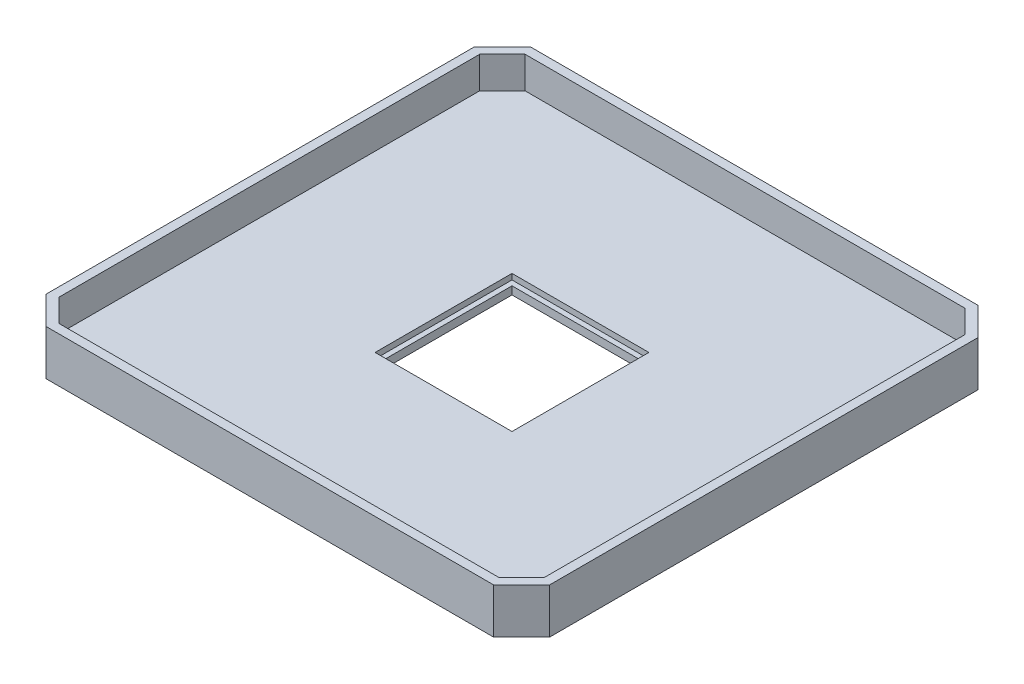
ISO-10303-21;
HEADER;
FILE_DESCRIPTION(('STEP AP214'),'2;1');
FILE_NAME('part.step','',(''),(''),'','','');
FILE_SCHEMA(('AUTOMOTIVE_DESIGN { 1 0 10303 214 1 1 1 1 }'));
ENDSEC;
DATA;
#1=APPLICATION_CONTEXT('core data for automotive mechanical design processes');
#2=APPLICATION_PROTOCOL_DEFINITION('international standard','automotive_design',2000,#1);
#3=PRODUCT_CONTEXT('',#1,'mechanical');
#4=PRODUCT('Part','Part','',(#3));
#5=PRODUCT_RELATED_PRODUCT_CATEGORY('part','',(#4));
#6=PRODUCT_DEFINITION_FORMATION('','',#4);
#7=PRODUCT_DEFINITION_CONTEXT('part definition',#1,'design');
#8=PRODUCT_DEFINITION('design','',#6,#7);
#9=PRODUCT_DEFINITION_SHAPE('','',#8);
#10=(LENGTH_UNIT() NAMED_UNIT(*) SI_UNIT(.MILLI.,.METRE.));
#11=(NAMED_UNIT(*) PLANE_ANGLE_UNIT() SI_UNIT($,.RADIAN.));
#12=(NAMED_UNIT(*) SI_UNIT($,.STERADIAN.) SOLID_ANGLE_UNIT());
#13=UNCERTAINTY_MEASURE_WITH_UNIT(LENGTH_MEASURE(1.E-05),#10,'distance_accuracy_value','');
#14=(GEOMETRIC_REPRESENTATION_CONTEXT(3) GLOBAL_UNCERTAINTY_ASSIGNED_CONTEXT((#13)) GLOBAL_UNIT_ASSIGNED_CONTEXT((#10,
#11,#12)) REPRESENTATION_CONTEXT('',''));
#15=CARTESIAN_POINT('',(0.,0.,0.));
#16=DIRECTION('',(0.,0.,1.));
#17=DIRECTION('',(1.,0.,0.));
#18=AXIS2_PLACEMENT_3D('',#15,#16,#17);
#19=CARTESIAN_POINT('',(0.,10.,0.));
#20=DIRECTION('',(0.,1.,0.));
#21=DIRECTION('',(0.,0.,1.));
#22=AXIS2_PLACEMENT_3D('',#19,#20,#21);
#23=PLANE('',#22);
#24=DIRECTION('',(0.707106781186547,0.,0.707106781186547));
#25=VECTOR('',#24,1.);
#26=CARTESIAN_POINT('',(-55.625,10.,47.3284271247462));
#27=LINE('',#26,#25);
#28=CARTESIAN_POINT('',(-55.625,10.,47.3284271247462));
#29=VERTEX_POINT('',#28);
#30=CARTESIAN_POINT('',(-49.4534271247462,10.,53.5));
#31=VERTEX_POINT('',#30);
#32=EDGE_CURVE('E372',#29,#31,#27,.T.);
#33=ORIENTED_EDGE('',*,*,#32,.T.);
#34=DIRECTION('',(1.,0.,0.));
#35=VECTOR('',#34,1.);
#36=CARTESIAN_POINT('',(-49.4534271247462,10.,53.5));
#37=LINE('',#36,#35);
#38=CARTESIAN_POINT('',(49.4534271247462,10.,53.5));
#39=VERTEX_POINT('',#38);
#40=EDGE_CURVE('E376',#31,#39,#37,.T.);
#41=ORIENTED_EDGE('',*,*,#40,.T.);
#42=DIRECTION('',(0.707106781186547,0.,-0.707106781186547));
#43=VECTOR('',#42,1.);
#44=CARTESIAN_POINT('',(49.4534271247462,10.,53.5));
#45=LINE('',#44,#43);
#46=CARTESIAN_POINT('',(55.625,10.,47.3284271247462));
#47=VERTEX_POINT('',#46);
#48=EDGE_CURVE('E380',#39,#47,#45,.T.);
#49=ORIENTED_EDGE('',*,*,#48,.T.);
#50=DIRECTION('',(0.,0.,-1.));
#51=VECTOR('',#50,1.);
#52=CARTESIAN_POINT('',(55.625,10.,47.3284271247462));
#53=LINE('',#52,#51);
#54=CARTESIAN_POINT('',(55.625,10.,-47.3284271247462));
#55=VERTEX_POINT('',#54);
#56=EDGE_CURVE('E383',#47,#55,#53,.T.);
#57=ORIENTED_EDGE('',*,*,#56,.T.);
#58=DIRECTION('',(-0.707106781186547,0.,-0.707106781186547));
#59=VECTOR('',#58,1.);
#60=CARTESIAN_POINT('',(49.4534271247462,10.,-53.5));
#61=LINE('',#60,#59);
#62=CARTESIAN_POINT('',(49.4534271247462,10.,-53.5));
#63=VERTEX_POINT('',#62);
#64=EDGE_CURVE('E386',#55,#63,#61,.T.);
#65=ORIENTED_EDGE('',*,*,#64,.T.);
#66=DIRECTION('',(-1.,0.,0.));
#67=VECTOR('',#66,1.);
#68=CARTESIAN_POINT('',(-49.4534271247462,10.,-53.5));
#69=LINE('',#68,#67);
#70=CARTESIAN_POINT('',(-49.4534271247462,10.,-53.5));
#71=VERTEX_POINT('',#70);
#72=EDGE_CURVE('E389',#63,#71,#69,.T.);
#73=ORIENTED_EDGE('',*,*,#72,.T.);
#74=DIRECTION('',(-0.707106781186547,0.,0.707106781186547));
#75=VECTOR('',#74,1.);
#76=CARTESIAN_POINT('',(-55.625,10.,-47.3284271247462));
#77=LINE('',#76,#75);
#78=CARTESIAN_POINT('',(-55.625,10.,-47.3284271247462));
#79=VERTEX_POINT('',#78);
#80=EDGE_CURVE('E392',#71,#79,#77,.T.);
#81=ORIENTED_EDGE('',*,*,#80,.T.);
#82=DIRECTION('',(0.,0.,1.));
#83=VECTOR('',#82,1.);
#84=CARTESIAN_POINT('',(-55.625,10.,47.3284271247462));
#85=LINE('',#84,#83);
#86=EDGE_CURVE('E395',#79,#29,#85,.T.);
#87=ORIENTED_EDGE('',*,*,#86,.T.);
#88=EDGE_LOOP('',(#33,#41,#49,#57,#65,#73,#81,#87));
#89=FACE_BOUND('',#88,.T.);
#90=DIRECTION('',(-0.707106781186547,0.,0.707106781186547));
#91=VECTOR('',#90,1.);
#92=CARTESIAN_POINT('',(-53.625,10.,-46.5));
#93=LINE('',#92,#91);
#94=CARTESIAN_POINT('',(-48.625,10.,-51.5));
#95=VERTEX_POINT('',#94);
#96=CARTESIAN_POINT('',(-53.625,10.,-46.5));
#97=VERTEX_POINT('',#96);
#98=EDGE_CURVE('E318',#95,#97,#93,.T.);
#99=ORIENTED_EDGE('',*,*,#98,.F.);
#100=DIRECTION('',(-1.,0.,0.));
#101=VECTOR('',#100,1.);
#102=CARTESIAN_POINT('',(-48.625,10.,-51.5));
#103=LINE('',#102,#101);
#104=CARTESIAN_POINT('',(48.625,10.,-51.5));
#105=VERTEX_POINT('',#104);
#106=EDGE_CURVE('E315',#105,#95,#103,.T.);
#107=ORIENTED_EDGE('',*,*,#106,.F.);
#108=DIRECTION('',(-0.707106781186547,0.,-0.707106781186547));
#109=VECTOR('',#108,1.);
#110=CARTESIAN_POINT('',(48.625,10.,-51.5));
#111=LINE('',#110,#109);
#112=CARTESIAN_POINT('',(53.625,10.,-46.5));
#113=VERTEX_POINT('',#112);
#114=EDGE_CURVE('E337',#113,#105,#111,.T.);
#115=ORIENTED_EDGE('',*,*,#114,.F.);
#116=DIRECTION('',(0.,0.,-1.));
#117=VECTOR('',#116,1.);
#118=CARTESIAN_POINT('',(53.625,10.,46.5));
#119=LINE('',#118,#117);
#120=CARTESIAN_POINT('',(53.625,10.,46.5));
#121=VERTEX_POINT('',#120);
#122=EDGE_CURVE('E333',#121,#113,#119,.T.);
#123=ORIENTED_EDGE('',*,*,#122,.F.);
#124=DIRECTION('',(0.707106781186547,0.,-0.707106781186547));
#125=VECTOR('',#124,1.);
#126=CARTESIAN_POINT('',(48.625,10.,51.5));
#127=LINE('',#126,#125);
#128=CARTESIAN_POINT('',(48.625,10.,51.5));
#129=VERTEX_POINT('',#128);
#130=EDGE_CURVE('E330',#129,#121,#127,.T.);
#131=ORIENTED_EDGE('',*,*,#130,.F.);
#132=DIRECTION('',(1.,0.,0.));
#133=VECTOR('',#132,1.);
#134=CARTESIAN_POINT('',(-48.625,10.,51.5));
#135=LINE('',#134,#133);
#136=CARTESIAN_POINT('',(-48.625,10.,51.5));
#137=VERTEX_POINT('',#136);
#138=EDGE_CURVE('E327',#137,#129,#135,.T.);
#139=ORIENTED_EDGE('',*,*,#138,.F.);
#140=DIRECTION('',(0.707106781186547,0.,0.707106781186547));
#141=VECTOR('',#140,1.);
#142=CARTESIAN_POINT('',(-53.625,10.,46.5));
#143=LINE('',#142,#141);
#144=CARTESIAN_POINT('',(-53.625,10.,46.5));
#145=VERTEX_POINT('',#144);
#146=EDGE_CURVE('E324',#145,#137,#143,.T.);
#147=ORIENTED_EDGE('',*,*,#146,.F.);
#148=DIRECTION('',(0.,0.,1.));
#149=VECTOR('',#148,1.);
#150=CARTESIAN_POINT('',(-53.625,10.,46.5));
#151=LINE('',#150,#149);
#152=EDGE_CURVE('E321',#97,#145,#151,.T.);
#153=ORIENTED_EDGE('',*,*,#152,.F.);
#154=EDGE_LOOP('',(#99,#107,#115,#123,#131,#139,#147,#153));
#155=FACE_BOUND('',#154,.T.);
#156=ADVANCED_FACE('F41',(#89,#155),#23,.T.);
#157=CARTESIAN_POINT('',(0.,0.,0.));
#158=DIRECTION('',(0.,1.,0.));
#159=DIRECTION('',(0.,0.,1.));
#160=AXIS2_PLACEMENT_3D('',#157,#158,#159);
#161=PLANE('',#160);
#162=DIRECTION('',(0.707106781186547,0.,0.707106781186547));
#163=VECTOR('',#162,1.);
#164=CARTESIAN_POINT('',(-55.625,0.,47.3284271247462));
#165=LINE('',#164,#163);
#166=CARTESIAN_POINT('',(-55.625,0.,47.3284271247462));
#167=VERTEX_POINT('',#166);
#168=CARTESIAN_POINT('',(-49.4534271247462,0.,53.5));
#169=VERTEX_POINT('',#168);
#170=EDGE_CURVE('E371',#167,#169,#165,.T.);
#171=ORIENTED_EDGE('',*,*,#170,.F.);
#172=DIRECTION('',(0.,0.,1.));
#173=VECTOR('',#172,1.);
#174=CARTESIAN_POINT('',(-55.625,0.,47.3284271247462));
#175=LINE('',#174,#173);
#176=CARTESIAN_POINT('',(-55.625,0.,-47.3284271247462));
#177=VERTEX_POINT('',#176);
#178=EDGE_CURVE('E377',#177,#167,#175,.T.);
#179=ORIENTED_EDGE('',*,*,#178,.F.);
#180=DIRECTION('',(-0.707106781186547,0.,0.707106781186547));
#181=VECTOR('',#180,1.);
#182=CARTESIAN_POINT('',(-55.625,0.,-47.3284271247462));
#183=LINE('',#182,#181);
#184=CARTESIAN_POINT('',(-49.4534271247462,0.,-53.5));
#185=VERTEX_POINT('',#184);
#186=EDGE_CURVE('E417',#185,#177,#183,.T.);
#187=ORIENTED_EDGE('',*,*,#186,.F.);
#188=DIRECTION('',(-1.,0.,0.));
#189=VECTOR('',#188,1.);
#190=CARTESIAN_POINT('',(-49.4534271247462,0.,-53.5));
#191=LINE('',#190,#189);
#192=CARTESIAN_POINT('',(49.4534271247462,0.,-53.5));
#193=VERTEX_POINT('',#192);
#194=EDGE_CURVE('E414',#193,#185,#191,.T.);
#195=ORIENTED_EDGE('',*,*,#194,.F.);
#196=DIRECTION('',(-0.707106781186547,0.,-0.707106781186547));
#197=VECTOR('',#196,1.);
#198=CARTESIAN_POINT('',(49.4534271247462,0.,-53.5));
#199=LINE('',#198,#197);
#200=CARTESIAN_POINT('',(55.625,0.,-47.3284271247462));
#201=VERTEX_POINT('',#200);
#202=EDGE_CURVE('E411',#201,#193,#199,.T.);
#203=ORIENTED_EDGE('',*,*,#202,.F.);
#204=DIRECTION('',(0.,0.,-1.));
#205=VECTOR('',#204,1.);
#206=CARTESIAN_POINT('',(55.625,0.,47.3284271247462));
#207=LINE('',#206,#205);
#208=CARTESIAN_POINT('',(55.625,0.,47.3284271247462));
#209=VERTEX_POINT('',#208);
#210=EDGE_CURVE('E408',#209,#201,#207,.T.);
#211=ORIENTED_EDGE('',*,*,#210,.F.);
#212=DIRECTION('',(0.707106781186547,0.,-0.707106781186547));
#213=VECTOR('',#212,1.);
#214=CARTESIAN_POINT('',(49.4534271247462,0.,53.5));
#215=LINE('',#214,#213);
#216=CARTESIAN_POINT('',(49.4534271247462,0.,53.5));
#217=VERTEX_POINT('',#216);
#218=EDGE_CURVE('E405',#217,#209,#215,.T.);
#219=ORIENTED_EDGE('',*,*,#218,.F.);
#220=DIRECTION('',(1.,0.,0.));
#221=VECTOR('',#220,1.);
#222=CARTESIAN_POINT('',(-49.4534271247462,0.,53.5));
#223=LINE('',#222,#221);
#224=EDGE_CURVE('E402',#169,#217,#223,.T.);
#225=ORIENTED_EDGE('',*,*,#224,.F.);
#226=EDGE_LOOP('',(#171,#179,#187,#195,#203,#211,#219,#225));
#227=FACE_BOUND('',#226,.T.);
#228=DIRECTION('',(-1.,0.,0.));
#229=VECTOR('',#228,1.);
#230=CARTESIAN_POINT('',(-14.,0.,14.));
#231=LINE('',#230,#229);
#232=CARTESIAN_POINT('',(14.,0.,14.));
#233=VERTEX_POINT('',#232);
#234=CARTESIAN_POINT('',(-14.,0.,14.));
#235=VERTEX_POINT('',#234);
#236=EDGE_CURVE('E266',#233,#235,#231,.T.);
#237=ORIENTED_EDGE('',*,*,#236,.F.);
#238=DIRECTION('',(0.,0.,1.));
#239=VECTOR('',#238,1.);
#240=CARTESIAN_POINT('',(14.,0.,-14.));
#241=LINE('',#240,#239);
#242=CARTESIAN_POINT('',(14.,0.,-14.));
#243=VERTEX_POINT('',#242);
#244=EDGE_CURVE('E262',#243,#233,#241,.T.);
#245=ORIENTED_EDGE('',*,*,#244,.F.);
#246=DIRECTION('',(1.,0.,0.));
#247=VECTOR('',#246,1.);
#248=CARTESIAN_POINT('',(-14.,0.,-14.));
#249=LINE('',#248,#247);
#250=CARTESIAN_POINT('',(-14.,0.,-14.));
#251=VERTEX_POINT('',#250);
#252=EDGE_CURVE('E274',#251,#243,#249,.T.);
#253=ORIENTED_EDGE('',*,*,#252,.F.);
#254=DIRECTION('',(0.,0.,-1.));
#255=VECTOR('',#254,1.);
#256=CARTESIAN_POINT('',(-14.,0.,-14.));
#257=LINE('',#256,#255);
#258=EDGE_CURVE('E270',#235,#251,#257,.T.);
#259=ORIENTED_EDGE('',*,*,#258,.F.);
#260=EDGE_LOOP('',(#237,#245,#253,#259));
#261=FACE_BOUND('',#260,.T.);
#262=ADVANCED_FACE('F460',(#227,#261),#161,.F.);
#263=CARTESIAN_POINT('',(-55.625,10.,47.3284271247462));
#264=DIRECTION('',(0.707106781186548,0.,-0.707106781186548));
#265=DIRECTION('',(-0.707106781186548,0.,-0.707106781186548));
#266=AXIS2_PLACEMENT_3D('',#263,#264,#265);
#267=PLANE('',#266);
#268=ORIENTED_EDGE('',*,*,#170,.T.);
#269=DIRECTION('',(0.,-1.,0.));
#270=VECTOR('',#269,1.);
#271=CARTESIAN_POINT('',(-49.4534271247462,10.,53.5));
#272=LINE('',#271,#270);
#273=EDGE_CURVE('E50',#31,#169,#272,.T.);
#274=ORIENTED_EDGE('',*,*,#273,.F.);
#275=ORIENTED_EDGE('',*,*,#32,.F.);
#276=DIRECTION('',(0.,-1.,0.));
#277=VECTOR('',#276,1.);
#278=CARTESIAN_POINT('',(-55.625,10.,47.3284271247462));
#279=LINE('',#278,#277);
#280=EDGE_CURVE('E398',#29,#167,#279,.T.);
#281=ORIENTED_EDGE('',*,*,#280,.T.);
#282=EDGE_LOOP('',(#268,#274,#275,#281));
#283=FACE_BOUND('',#282,.T.);
#284=ADVANCED_FACE('F43',(#283),#267,.F.);
#285=CARTESIAN_POINT('',(-49.4534271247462,10.,53.5));
#286=DIRECTION('',(0.,0.,-1.));
#287=DIRECTION('',(-1.,0.,0.));
#288=AXIS2_PLACEMENT_3D('',#285,#286,#287);
#289=PLANE('',#288);
#290=ORIENTED_EDGE('',*,*,#224,.T.);
#291=DIRECTION('',(0.,-1.,0.));
#292=VECTOR('',#291,1.);
#293=CARTESIAN_POINT('',(49.4534271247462,10.,53.5));
#294=LINE('',#293,#292);
#295=EDGE_CURVE('E445',#39,#217,#294,.T.);
#296=ORIENTED_EDGE('',*,*,#295,.F.);
#297=ORIENTED_EDGE('',*,*,#40,.F.);
#298=ORIENTED_EDGE('',*,*,#273,.T.);
#299=EDGE_LOOP('',(#290,#296,#297,#298));
#300=FACE_BOUND('',#299,.T.);
#301=ADVANCED_FACE('F452',(#300),#289,.F.);
#302=CARTESIAN_POINT('',(49.4534271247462,10.,53.5));
#303=DIRECTION('',(-0.707106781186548,0.,-0.707106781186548));
#304=DIRECTION('',(-0.707106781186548,0.,0.707106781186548));
#305=AXIS2_PLACEMENT_3D('',#302,#303,#304);
#306=PLANE('',#305);
#307=ORIENTED_EDGE('',*,*,#218,.T.);
#308=DIRECTION('',(0.,-1.,0.));
#309=VECTOR('',#308,1.);
#310=CARTESIAN_POINT('',(55.625,10.,47.3284271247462));
#311=LINE('',#310,#309);
#312=EDGE_CURVE('E441',#47,#209,#311,.T.);
#313=ORIENTED_EDGE('',*,*,#312,.F.);
#314=ORIENTED_EDGE('',*,*,#48,.F.);
#315=ORIENTED_EDGE('',*,*,#295,.T.);
#316=EDGE_LOOP('',(#307,#313,#314,#315));
#317=FACE_BOUND('',#316,.T.);
#318=ADVANCED_FACE('F468',(#317),#306,.F.);
#319=CARTESIAN_POINT('',(55.625,10.,47.3284271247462));
#320=DIRECTION('',(-1.,0.,0.));
#321=DIRECTION('',(0.,0.,1.));
#322=AXIS2_PLACEMENT_3D('',#319,#320,#321);
#323=PLANE('',#322);
#324=ORIENTED_EDGE('',*,*,#210,.T.);
#325=DIRECTION('',(0.,-1.,0.));
#326=VECTOR('',#325,1.);
#327=CARTESIAN_POINT('',(55.625,10.,-47.3284271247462));
#328=LINE('',#327,#326);
#329=EDGE_CURVE('E437',#55,#201,#328,.T.);
#330=ORIENTED_EDGE('',*,*,#329,.F.);
#331=ORIENTED_EDGE('',*,*,#56,.F.);
#332=ORIENTED_EDGE('',*,*,#312,.T.);
#333=EDGE_LOOP('',(#324,#330,#331,#332));
#334=FACE_BOUND('',#333,.T.);
#335=ADVANCED_FACE('F472',(#334),#323,.F.);
#336=CARTESIAN_POINT('',(49.4534271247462,10.,-53.5));
#337=DIRECTION('',(-0.707106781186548,0.,0.707106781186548));
#338=DIRECTION('',(0.707106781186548,0.,0.707106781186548));
#339=AXIS2_PLACEMENT_3D('',#336,#337,#338);
#340=PLANE('',#339);
#341=ORIENTED_EDGE('',*,*,#202,.T.);
#342=DIRECTION('',(0.,-1.,0.));
#343=VECTOR('',#342,1.);
#344=CARTESIAN_POINT('',(49.4534271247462,10.,-53.5));
#345=LINE('',#344,#343);
#346=EDGE_CURVE('E433',#63,#193,#345,.T.);
#347=ORIENTED_EDGE('',*,*,#346,.F.);
#348=ORIENTED_EDGE('',*,*,#64,.F.);
#349=ORIENTED_EDGE('',*,*,#329,.T.);
#350=EDGE_LOOP('',(#341,#347,#348,#349));
#351=FACE_BOUND('',#350,.T.);
#352=ADVANCED_FACE('F491',(#351),#340,.F.);
#353=CARTESIAN_POINT('',(-49.4534271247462,10.,-53.5));
#354=DIRECTION('',(0.,0.,1.));
#355=DIRECTION('',(1.,0.,0.));
#356=AXIS2_PLACEMENT_3D('',#353,#354,#355);
#357=PLANE('',#356);
#358=ORIENTED_EDGE('',*,*,#194,.T.);
#359=DIRECTION('',(0.,-1.,0.));
#360=VECTOR('',#359,1.);
#361=CARTESIAN_POINT('',(-49.4534271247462,10.,-53.5));
#362=LINE('',#361,#360);
#363=EDGE_CURVE('E429',#71,#185,#362,.T.);
#364=ORIENTED_EDGE('',*,*,#363,.F.);
#365=ORIENTED_EDGE('',*,*,#72,.F.);
#366=ORIENTED_EDGE('',*,*,#346,.T.);
#367=EDGE_LOOP('',(#358,#364,#365,#366));
#368=FACE_BOUND('',#367,.T.);
#369=ADVANCED_FACE('F488',(#368),#357,.F.);
#370=CARTESIAN_POINT('',(-55.625,10.,-47.3284271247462));
#371=DIRECTION('',(0.707106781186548,0.,0.707106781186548));
#372=DIRECTION('',(0.707106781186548,0.,-0.707106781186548));
#373=AXIS2_PLACEMENT_3D('',#370,#371,#372);
#374=PLANE('',#373);
#375=ORIENTED_EDGE('',*,*,#186,.T.);
#376=DIRECTION('',(0.,-1.,0.));
#377=VECTOR('',#376,1.);
#378=CARTESIAN_POINT('',(-55.625,10.,-47.3284271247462));
#379=LINE('',#378,#377);
#380=EDGE_CURVE('E425',#79,#177,#379,.T.);
#381=ORIENTED_EDGE('',*,*,#380,.F.);
#382=ORIENTED_EDGE('',*,*,#80,.F.);
#383=ORIENTED_EDGE('',*,*,#363,.T.);
#384=EDGE_LOOP('',(#375,#381,#382,#383));
#385=FACE_BOUND('',#384,.T.);
#386=ADVANCED_FACE('F484',(#385),#374,.F.);
#387=CARTESIAN_POINT('',(-55.625,10.,47.3284271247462));
#388=DIRECTION('',(1.,0.,0.));
#389=DIRECTION('',(0.,0.,-1.));
#390=AXIS2_PLACEMENT_3D('',#387,#388,#389);
#391=PLANE('',#390);
#392=ORIENTED_EDGE('',*,*,#178,.T.);
#393=ORIENTED_EDGE('',*,*,#280,.F.);
#394=ORIENTED_EDGE('',*,*,#86,.F.);
#395=ORIENTED_EDGE('',*,*,#380,.T.);
#396=EDGE_LOOP('',(#392,#393,#394,#395));
#397=FACE_BOUND('',#396,.T.);
#398=ADVANCED_FACE('F482',(#397),#391,.F.);
#399=CARTESIAN_POINT('',(-48.625,10.,-51.5));
#400=DIRECTION('',(0.,0.,1.));
#401=DIRECTION('',(1.,0.,0.));
#402=AXIS2_PLACEMENT_3D('',#399,#400,#401);
#403=PLANE('',#402);
#404=DIRECTION('',(1.,0.,0.));
#405=VECTOR('',#404,1.);
#406=CARTESIAN_POINT('',(48.625,3.,-51.5));
#407=LINE('',#406,#405);
#408=CARTESIAN_POINT('',(-48.625,3.,-51.5));
#409=VERTEX_POINT('',#408);
#410=CARTESIAN_POINT('',(48.625,3.,-51.5));
#411=VERTEX_POINT('',#410);
#412=EDGE_CURVE('E302',#409,#411,#407,.T.);
#413=ORIENTED_EDGE('',*,*,#412,.T.);
#414=DIRECTION('',(0.,-1.,0.));
#415=VECTOR('',#414,1.);
#416=CARTESIAN_POINT('',(48.625,10.,-51.5));
#417=LINE('',#416,#415);
#418=EDGE_CURVE('E340',#105,#411,#417,.T.);
#419=ORIENTED_EDGE('',*,*,#418,.F.);
#420=ORIENTED_EDGE('',*,*,#106,.T.);
#421=DIRECTION('',(0.,-1.,0.));
#422=VECTOR('',#421,1.);
#423=CARTESIAN_POINT('',(-48.625,10.,-51.5));
#424=LINE('',#423,#422);
#425=EDGE_CURVE('E367',#95,#409,#424,.T.);
#426=ORIENTED_EDGE('',*,*,#425,.T.);
#427=EDGE_LOOP('',(#413,#419,#420,#426));
#428=FACE_BOUND('',#427,.T.);
#429=ADVANCED_FACE('F507',(#428),#403,.T.);
#430=CARTESIAN_POINT('',(-53.625,10.,-46.5));
#431=DIRECTION('',(0.707106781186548,0.,0.707106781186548));
#432=DIRECTION('',(0.707106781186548,0.,-0.707106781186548));
#433=AXIS2_PLACEMENT_3D('',#430,#431,#432);
#434=PLANE('',#433);
#435=DIRECTION('',(0.707106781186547,0.,-0.707106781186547));
#436=VECTOR('',#435,1.);
#437=CARTESIAN_POINT('',(-48.625,3.,-51.5));
#438=LINE('',#437,#436);
#439=CARTESIAN_POINT('',(-53.625,3.,-46.5));
#440=VERTEX_POINT('',#439);
#441=EDGE_CURVE('E299',#440,#409,#438,.T.);
#442=ORIENTED_EDGE('',*,*,#441,.T.);
#443=ORIENTED_EDGE('',*,*,#425,.F.);
#444=ORIENTED_EDGE('',*,*,#98,.T.);
#445=DIRECTION('',(0.,-1.,0.));
#446=VECTOR('',#445,1.);
#447=CARTESIAN_POINT('',(-53.625,10.,-46.5));
#448=LINE('',#447,#446);
#449=EDGE_CURVE('E363',#97,#440,#448,.T.);
#450=ORIENTED_EDGE('',*,*,#449,.T.);
#451=EDGE_LOOP('',(#442,#443,#444,#450));
#452=FACE_BOUND('',#451,.T.);
#453=ADVANCED_FACE('F528',(#452),#434,.T.);
#454=CARTESIAN_POINT('',(-53.625,10.,46.5));
#455=DIRECTION('',(1.,0.,0.));
#456=DIRECTION('',(0.,0.,-1.));
#457=AXIS2_PLACEMENT_3D('',#454,#455,#456);
#458=PLANE('',#457);
#459=DIRECTION('',(0.,0.,-1.));
#460=VECTOR('',#459,1.);
#461=CARTESIAN_POINT('',(-53.625,3.,-46.5));
#462=LINE('',#461,#460);
#463=CARTESIAN_POINT('',(-53.625,3.,46.5));
#464=VERTEX_POINT('',#463);
#465=EDGE_CURVE('E296',#464,#440,#462,.T.);
#466=ORIENTED_EDGE('',*,*,#465,.T.);
#467=ORIENTED_EDGE('',*,*,#449,.F.);
#468=ORIENTED_EDGE('',*,*,#152,.T.);
#469=DIRECTION('',(0.,-1.,0.));
#470=VECTOR('',#469,1.);
#471=CARTESIAN_POINT('',(-53.625,10.,46.5));
#472=LINE('',#471,#470);
#473=EDGE_CURVE('E359',#145,#464,#472,.T.);
#474=ORIENTED_EDGE('',*,*,#473,.T.);
#475=EDGE_LOOP('',(#466,#467,#468,#474));
#476=FACE_BOUND('',#475,.T.);
#477=ADVANCED_FACE('F535',(#476),#458,.T.);
#478=CARTESIAN_POINT('',(-53.625,10.,46.5));
#479=DIRECTION('',(0.707106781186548,0.,-0.707106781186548));
#480=DIRECTION('',(-0.707106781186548,0.,-0.707106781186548));
#481=AXIS2_PLACEMENT_3D('',#478,#479,#480);
#482=PLANE('',#481);
#483=DIRECTION('',(-0.707106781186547,0.,-0.707106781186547));
#484=VECTOR('',#483,1.);
#485=CARTESIAN_POINT('',(-53.625,3.,46.5));
#486=LINE('',#485,#484);
#487=CARTESIAN_POINT('',(-48.625,3.,51.5));
#488=VERTEX_POINT('',#487);
#489=EDGE_CURVE('E293',#488,#464,#486,.T.);
#490=ORIENTED_EDGE('',*,*,#489,.T.);
#491=ORIENTED_EDGE('',*,*,#473,.F.);
#492=ORIENTED_EDGE('',*,*,#146,.T.);
#493=DIRECTION('',(0.,-1.,0.));
#494=VECTOR('',#493,1.);
#495=CARTESIAN_POINT('',(-48.625,10.,51.5));
#496=LINE('',#495,#494);
#497=EDGE_CURVE('E355',#137,#488,#496,.T.);
#498=ORIENTED_EDGE('',*,*,#497,.T.);
#499=EDGE_LOOP('',(#490,#491,#492,#498));
#500=FACE_BOUND('',#499,.T.);
#501=ADVANCED_FACE('F542',(#500),#482,.T.);
#502=CARTESIAN_POINT('',(-48.625,10.,51.5));
#503=DIRECTION('',(0.,0.,-1.));
#504=DIRECTION('',(-1.,0.,0.));
#505=AXIS2_PLACEMENT_3D('',#502,#503,#504);
#506=PLANE('',#505);
#507=DIRECTION('',(-1.,0.,0.));
#508=VECTOR('',#507,1.);
#509=CARTESIAN_POINT('',(-48.625,3.,51.5));
#510=LINE('',#509,#508);
#511=CARTESIAN_POINT('',(48.625,3.,51.5));
#512=VERTEX_POINT('',#511);
#513=EDGE_CURVE('E282',#512,#488,#510,.T.);
#514=ORIENTED_EDGE('',*,*,#513,.T.);
#515=ORIENTED_EDGE('',*,*,#497,.F.);
#516=ORIENTED_EDGE('',*,*,#138,.T.);
#517=DIRECTION('',(0.,-1.,0.));
#518=VECTOR('',#517,1.);
#519=CARTESIAN_POINT('',(48.625,10.,51.5));
#520=LINE('',#519,#518);
#521=EDGE_CURVE('E351',#129,#512,#520,.T.);
#522=ORIENTED_EDGE('',*,*,#521,.T.);
#523=EDGE_LOOP('',(#514,#515,#516,#522));
#524=FACE_BOUND('',#523,.T.);
#525=ADVANCED_FACE('F550',(#524),#506,.T.);
#526=CARTESIAN_POINT('',(48.625,10.,51.5));
#527=DIRECTION('',(-0.707106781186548,0.,-0.707106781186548));
#528=DIRECTION('',(-0.707106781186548,0.,0.707106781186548));
#529=AXIS2_PLACEMENT_3D('',#526,#527,#528);
#530=PLANE('',#529);
#531=DIRECTION('',(-0.707106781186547,0.,0.707106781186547));
#532=VECTOR('',#531,1.);
#533=CARTESIAN_POINT('',(48.625,3.,51.5));
#534=LINE('',#533,#532);
#535=CARTESIAN_POINT('',(53.625,3.,46.5));
#536=VERTEX_POINT('',#535);
#537=EDGE_CURVE('E312',#536,#512,#534,.T.);
#538=ORIENTED_EDGE('',*,*,#537,.T.);
#539=ORIENTED_EDGE('',*,*,#521,.F.);
#540=ORIENTED_EDGE('',*,*,#130,.T.);
#541=DIRECTION('',(0.,-1.,0.));
#542=VECTOR('',#541,1.);
#543=CARTESIAN_POINT('',(53.625,10.,46.5));
#544=LINE('',#543,#542);
#545=EDGE_CURVE('E347',#121,#536,#544,.T.);
#546=ORIENTED_EDGE('',*,*,#545,.T.);
#547=EDGE_LOOP('',(#538,#539,#540,#546));
#548=FACE_BOUND('',#547,.T.);
#549=ADVANCED_FACE('F558',(#548),#530,.T.);
#550=CARTESIAN_POINT('',(53.625,10.,46.5));
#551=DIRECTION('',(-1.,0.,0.));
#552=DIRECTION('',(0.,0.,1.));
#553=AXIS2_PLACEMENT_3D('',#550,#551,#552);
#554=PLANE('',#553);
#555=DIRECTION('',(0.,0.,1.));
#556=VECTOR('',#555,1.);
#557=CARTESIAN_POINT('',(53.625,3.,46.5));
#558=LINE('',#557,#556);
#559=CARTESIAN_POINT('',(53.625,3.,-46.5));
#560=VERTEX_POINT('',#559);
#561=EDGE_CURVE('E309',#560,#536,#558,.T.);
#562=ORIENTED_EDGE('',*,*,#561,.T.);
#563=ORIENTED_EDGE('',*,*,#545,.F.);
#564=ORIENTED_EDGE('',*,*,#122,.T.);
#565=DIRECTION('',(0.,-1.,0.));
#566=VECTOR('',#565,1.);
#567=CARTESIAN_POINT('',(53.625,10.,-46.5));
#568=LINE('',#567,#566);
#569=EDGE_CURVE('E343',#113,#560,#568,.T.);
#570=ORIENTED_EDGE('',*,*,#569,.T.);
#571=EDGE_LOOP('',(#562,#563,#564,#570));
#572=FACE_BOUND('',#571,.T.);
#573=ADVANCED_FACE('F566',(#572),#554,.T.);
#574=CARTESIAN_POINT('',(48.625,10.,-51.5));
#575=DIRECTION('',(-0.707106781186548,0.,0.707106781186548));
#576=DIRECTION('',(0.707106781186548,0.,0.707106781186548));
#577=AXIS2_PLACEMENT_3D('',#574,#575,#576);
#578=PLANE('',#577);
#579=DIRECTION('',(0.707106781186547,0.,0.707106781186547));
#580=VECTOR('',#579,1.);
#581=CARTESIAN_POINT('',(53.625,3.,-46.5));
#582=LINE('',#581,#580);
#583=EDGE_CURVE('E306',#411,#560,#582,.T.);
#584=ORIENTED_EDGE('',*,*,#583,.T.);
#585=ORIENTED_EDGE('',*,*,#569,.F.);
#586=ORIENTED_EDGE('',*,*,#114,.T.);
#587=ORIENTED_EDGE('',*,*,#418,.T.);
#588=EDGE_LOOP('',(#584,#585,#586,#587));
#589=FACE_BOUND('',#588,.T.);
#590=ADVANCED_FACE('F574',(#589),#578,.T.);
#591=CARTESIAN_POINT('',(0.,3.,0.));
#592=DIRECTION('',(0.,1.,0.));
#593=DIRECTION('',(0.,0.,1.));
#594=AXIS2_PLACEMENT_3D('',#591,#592,#593);
#595=PLANE('',#594);
#596=DIRECTION('',(0.,0.,-1.));
#597=VECTOR('',#596,1.);
#598=CARTESIAN_POINT('',(15.125,3.,15.125));
#599=LINE('',#598,#597);
#600=CARTESIAN_POINT('',(15.125,3.,15.125));
#601=VERTEX_POINT('',#600);
#602=CARTESIAN_POINT('',(15.125,3.,-15.125));
#603=VERTEX_POINT('',#602);
#604=EDGE_CURVE('E57',#601,#603,#599,.T.);
#605=ORIENTED_EDGE('',*,*,#604,.F.);
#606=DIRECTION('',(1.,0.,0.));
#607=VECTOR('',#606,1.);
#608=CARTESIAN_POINT('',(-15.125,3.,15.125));
#609=LINE('',#608,#607);
#610=CARTESIAN_POINT('',(-15.125,3.,15.125));
#611=VERTEX_POINT('',#610);
#612=EDGE_CURVE('E225',#611,#601,#609,.T.);
#613=ORIENTED_EDGE('',*,*,#612,.F.);
#614=DIRECTION('',(0.,0.,1.));
#615=VECTOR('',#614,1.);
#616=CARTESIAN_POINT('',(-15.125,3.,15.125));
#617=LINE('',#616,#615);
#618=CARTESIAN_POINT('',(-15.125,3.,-15.125));
#619=VERTEX_POINT('',#618);
#620=EDGE_CURVE('E229',#619,#611,#617,.T.);
#621=ORIENTED_EDGE('',*,*,#620,.F.);
#622=DIRECTION('',(-1.,0.,0.));
#623=VECTOR('',#622,1.);
#624=CARTESIAN_POINT('',(-15.125,3.,-15.125));
#625=LINE('',#624,#623);
#626=EDGE_CURVE('E238',#603,#619,#625,.T.);
#627=ORIENTED_EDGE('',*,*,#626,.F.);
#628=EDGE_LOOP('',(#605,#613,#621,#627));
#629=FACE_BOUND('',#628,.T.);
#630=ORIENTED_EDGE('',*,*,#513,.F.);
#631=ORIENTED_EDGE('',*,*,#537,.F.);
#632=ORIENTED_EDGE('',*,*,#561,.F.);
#633=ORIENTED_EDGE('',*,*,#583,.F.);
#634=ORIENTED_EDGE('',*,*,#412,.F.);
#635=ORIENTED_EDGE('',*,*,#441,.F.);
#636=ORIENTED_EDGE('',*,*,#465,.F.);
#637=ORIENTED_EDGE('',*,*,#489,.F.);
#638=EDGE_LOOP('',(#630,#631,#632,#633,#634,#635,#636,#637));
#639=FACE_BOUND('',#638,.T.);
#640=ADVANCED_FACE('F582',(#629,#639),#595,.T.);
#641=CARTESIAN_POINT('',(14.,3.,-14.));
#642=DIRECTION('',(1.,0.,0.));
#643=DIRECTION('',(0.,0.,-1.));
#644=AXIS2_PLACEMENT_3D('',#641,#642,#643);
#645=PLANE('',#644);
#646=DIRECTION('',(0.,-1.,0.));
#647=VECTOR('',#646,1.);
#648=CARTESIAN_POINT('',(14.,3.,14.));
#649=LINE('',#648,#647);
#650=CARTESIAN_POINT('',(14.,1.75,14.));
#651=VERTEX_POINT('',#650);
#652=EDGE_CURVE('E278',#651,#233,#649,.T.);
#653=ORIENTED_EDGE('',*,*,#652,.F.);
#654=DIRECTION('',(0.,0.,-1.));
#655=VECTOR('',#654,1.);
#656=CARTESIAN_POINT('',(14.,1.75,-14.));
#657=LINE('',#656,#655);
#658=CARTESIAN_POINT('',(14.,1.75,-14.));
#659=VERTEX_POINT('',#658);
#660=EDGE_CURVE('E65',#651,#659,#657,.T.);
#661=ORIENTED_EDGE('',*,*,#660,.T.);
#662=DIRECTION('',(0.,-1.,0.));
#663=VECTOR('',#662,1.);
#664=CARTESIAN_POINT('',(14.,3.,-14.));
#665=LINE('',#664,#663);
#666=EDGE_CURVE('E279',#659,#243,#665,.T.);
#667=ORIENTED_EDGE('',*,*,#666,.T.);
#668=ORIENTED_EDGE('',*,*,#244,.T.);
#669=EDGE_LOOP('',(#653,#661,#667,#668));
#670=FACE_BOUND('',#669,.T.);
#671=ADVANCED_FACE('F590',(#670),#645,.F.);
#672=CARTESIAN_POINT('',(-14.,3.,-14.));
#673=DIRECTION('',(0.,0.,-1.));
#674=DIRECTION('',(-1.,0.,0.));
#675=AXIS2_PLACEMENT_3D('',#672,#673,#674);
#676=PLANE('',#675);
#677=ORIENTED_EDGE('',*,*,#666,.F.);
#678=DIRECTION('',(-1.,0.,0.));
#679=VECTOR('',#678,1.);
#680=CARTESIAN_POINT('',(-14.,1.75,-14.));
#681=LINE('',#680,#679);
#682=CARTESIAN_POINT('',(-14.,1.75,-14.));
#683=VERTEX_POINT('',#682);
#684=EDGE_CURVE('E256',#659,#683,#681,.T.);
#685=ORIENTED_EDGE('',*,*,#684,.T.);
#686=DIRECTION('',(0.,-1.,0.));
#687=VECTOR('',#686,1.);
#688=CARTESIAN_POINT('',(-14.,3.,-14.));
#689=LINE('',#688,#687);
#690=EDGE_CURVE('E283',#683,#251,#689,.T.);
#691=ORIENTED_EDGE('',*,*,#690,.T.);
#692=ORIENTED_EDGE('',*,*,#252,.T.);
#693=EDGE_LOOP('',(#677,#685,#691,#692));
#694=FACE_BOUND('',#693,.T.);
#695=ADVANCED_FACE('F598',(#694),#676,.F.);
#696=CARTESIAN_POINT('',(-14.,3.,-14.));
#697=DIRECTION('',(-1.,0.,0.));
#698=DIRECTION('',(0.,0.,1.));
#699=AXIS2_PLACEMENT_3D('',#696,#697,#698);
#700=PLANE('',#699);
#701=ORIENTED_EDGE('',*,*,#690,.F.);
#702=DIRECTION('',(0.,0.,1.));
#703=VECTOR('',#702,1.);
#704=CARTESIAN_POINT('',(-14.,1.75,-14.));
#705=LINE('',#704,#703);
#706=CARTESIAN_POINT('',(-14.,1.75,14.));
#707=VERTEX_POINT('',#706);
#708=EDGE_CURVE('E247',#683,#707,#705,.T.);
#709=ORIENTED_EDGE('',*,*,#708,.T.);
#710=DIRECTION('',(0.,-1.,0.));
#711=VECTOR('',#710,1.);
#712=CARTESIAN_POINT('',(-14.,3.,14.));
#713=LINE('',#712,#711);
#714=EDGE_CURVE('E286',#707,#235,#713,.T.);
#715=ORIENTED_EDGE('',*,*,#714,.T.);
#716=ORIENTED_EDGE('',*,*,#258,.T.);
#717=EDGE_LOOP('',(#701,#709,#715,#716));
#718=FACE_BOUND('',#717,.T.);
#719=ADVANCED_FACE('F606',(#718),#700,.F.);
#720=CARTESIAN_POINT('',(-14.,3.,14.));
#721=DIRECTION('',(0.,0.,1.));
#722=DIRECTION('',(1.,0.,0.));
#723=AXIS2_PLACEMENT_3D('',#720,#721,#722);
#724=PLANE('',#723);
#725=ORIENTED_EDGE('',*,*,#714,.F.);
#726=DIRECTION('',(1.,0.,0.));
#727=VECTOR('',#726,1.);
#728=CARTESIAN_POINT('',(-14.,1.75,14.));
#729=LINE('',#728,#727);
#730=EDGE_CURVE('E11',#707,#651,#729,.T.);
#731=ORIENTED_EDGE('',*,*,#730,.T.);
#732=ORIENTED_EDGE('',*,*,#652,.T.);
#733=ORIENTED_EDGE('',*,*,#236,.T.);
#734=EDGE_LOOP('',(#725,#731,#732,#733));
#735=FACE_BOUND('',#734,.T.);
#736=ADVANCED_FACE('F614',(#735),#724,.F.);
#737=CARTESIAN_POINT('',(0.,1.75,0.));
#738=DIRECTION('',(0.,-1.,0.));
#739=DIRECTION('',(0.,0.,-1.));
#740=AXIS2_PLACEMENT_3D('',#737,#738,#739);
#741=PLANE('',#740);
#742=DIRECTION('',(0.,0.,-1.));
#743=VECTOR('',#742,1.);
#744=CARTESIAN_POINT('',(15.125,1.75,15.125));
#745=LINE('',#744,#743);
#746=CARTESIAN_POINT('',(15.125,1.75,15.125));
#747=VERTEX_POINT('',#746);
#748=CARTESIAN_POINT('',(15.125,1.75,-15.125));
#749=VERTEX_POINT('',#748);
#750=EDGE_CURVE('E204',#747,#749,#745,.T.);
#751=ORIENTED_EDGE('',*,*,#750,.T.);
#752=DIRECTION('',(-1.,0.,0.));
#753=VECTOR('',#752,1.);
#754=CARTESIAN_POINT('',(-15.125,1.75,-15.125));
#755=LINE('',#754,#753);
#756=CARTESIAN_POINT('',(-15.125,1.75,-15.125));
#757=VERTEX_POINT('',#756);
#758=EDGE_CURVE('E214',#749,#757,#755,.T.);
#759=ORIENTED_EDGE('',*,*,#758,.T.);
#760=DIRECTION('',(0.,0.,1.));
#761=VECTOR('',#760,1.);
#762=CARTESIAN_POINT('',(-15.125,1.75,15.125));
#763=LINE('',#762,#761);
#764=CARTESIAN_POINT('',(-15.125,1.75,15.125));
#765=VERTEX_POINT('',#764);
#766=EDGE_CURVE('E220',#757,#765,#763,.T.);
#767=ORIENTED_EDGE('',*,*,#766,.T.);
#768=DIRECTION('',(1.,0.,0.));
#769=VECTOR('',#768,1.);
#770=CARTESIAN_POINT('',(-15.125,1.75,15.125));
#771=LINE('',#770,#769);
#772=EDGE_CURVE('E211',#765,#747,#771,.T.);
#773=ORIENTED_EDGE('',*,*,#772,.T.);
#774=EDGE_LOOP('',(#751,#759,#767,#773));
#775=FACE_BOUND('',#774,.T.);
#776=ORIENTED_EDGE('',*,*,#730,.F.);
#777=ORIENTED_EDGE('',*,*,#708,.F.);
#778=ORIENTED_EDGE('',*,*,#684,.F.);
#779=ORIENTED_EDGE('',*,*,#660,.F.);
#780=EDGE_LOOP('',(#776,#777,#778,#779));
#781=FACE_BOUND('',#780,.T.);
#782=ADVANCED_FACE('F222',(#775,#781),#741,.F.);
#783=CARTESIAN_POINT('',(15.125,1.75,15.125));
#784=DIRECTION('',(1.,0.,0.));
#785=DIRECTION('',(0.,0.,-1.));
#786=AXIS2_PLACEMENT_3D('',#783,#784,#785);
#787=PLANE('',#786);
#788=ORIENTED_EDGE('',*,*,#604,.T.);
#789=DIRECTION('',(0.,1.,0.));
#790=VECTOR('',#789,1.);
#791=CARTESIAN_POINT('',(15.125,1.75,-15.125));
#792=LINE('',#791,#790);
#793=EDGE_CURVE('E200',#749,#603,#792,.T.);
#794=ORIENTED_EDGE('',*,*,#793,.F.);
#795=ORIENTED_EDGE('',*,*,#750,.F.);
#796=DIRECTION('',(0.,1.,0.));
#797=VECTOR('',#796,1.);
#798=CARTESIAN_POINT('',(15.125,1.75,15.125));
#799=LINE('',#798,#797);
#800=EDGE_CURVE('E244',#747,#601,#799,.T.);
#801=ORIENTED_EDGE('',*,*,#800,.T.);
#802=EDGE_LOOP('',(#788,#794,#795,#801));
#803=FACE_BOUND('',#802,.T.);
#804=ADVANCED_FACE('F202',(#803),#787,.F.);
#805=CARTESIAN_POINT('',(-15.125,1.75,15.125));
#806=DIRECTION('',(0.,0.,1.));
#807=DIRECTION('',(1.,0.,0.));
#808=AXIS2_PLACEMENT_3D('',#805,#806,#807);
#809=PLANE('',#808);
#810=ORIENTED_EDGE('',*,*,#612,.T.);
#811=ORIENTED_EDGE('',*,*,#800,.F.);
#812=ORIENTED_EDGE('',*,*,#772,.F.);
#813=DIRECTION('',(0.,1.,0.));
#814=VECTOR('',#813,1.);
#815=CARTESIAN_POINT('',(-15.125,1.75,15.125));
#816=LINE('',#815,#814);
#817=EDGE_CURVE('E248',#765,#611,#816,.T.);
#818=ORIENTED_EDGE('',*,*,#817,.T.);
#819=EDGE_LOOP('',(#810,#811,#812,#818));
#820=FACE_BOUND('',#819,.T.);
#821=ADVANCED_FACE('F635',(#820),#809,.F.);
#822=CARTESIAN_POINT('',(-15.125,1.75,15.125));
#823=DIRECTION('',(-1.,0.,0.));
#824=DIRECTION('',(0.,0.,1.));
#825=AXIS2_PLACEMENT_3D('',#822,#823,#824);
#826=PLANE('',#825);
#827=ORIENTED_EDGE('',*,*,#620,.T.);
#828=ORIENTED_EDGE('',*,*,#817,.F.);
#829=ORIENTED_EDGE('',*,*,#766,.F.);
#830=DIRECTION('',(0.,1.,0.));
#831=VECTOR('',#830,1.);
#832=CARTESIAN_POINT('',(-15.125,1.75,-15.125));
#833=LINE('',#832,#831);
#834=EDGE_CURVE('E210',#757,#619,#833,.T.);
#835=ORIENTED_EDGE('',*,*,#834,.T.);
#836=EDGE_LOOP('',(#827,#828,#829,#835));
#837=FACE_BOUND('',#836,.T.);
#838=ADVANCED_FACE('F642',(#837),#826,.F.);
#839=CARTESIAN_POINT('',(-15.125,1.75,-15.125));
#840=DIRECTION('',(0.,0.,-1.));
#841=DIRECTION('',(-1.,0.,0.));
#842=AXIS2_PLACEMENT_3D('',#839,#840,#841);
#843=PLANE('',#842);
#844=ORIENTED_EDGE('',*,*,#626,.T.);
#845=ORIENTED_EDGE('',*,*,#834,.F.);
#846=ORIENTED_EDGE('',*,*,#758,.F.);
#847=ORIENTED_EDGE('',*,*,#793,.T.);
#848=EDGE_LOOP('',(#844,#845,#846,#847));
#849=FACE_BOUND('',#848,.T.);
#850=ADVANCED_FACE('F215',(#849),#843,.F.);
#851=CLOSED_SHELL('',(#156,#262,#284,#301,#318,#335,#352,#369,#386,#398,#429,#453,#477,#501,
#525,#549,#573,#590,#640,#671,#695,#719,#736,#782,#804,#821,#838,#850));
#852=MANIFOLD_SOLID_BREP('B2',#851);
#853=ADVANCED_BREP_SHAPE_REPRESENTATION('',(#18,#852),#14);
#854=SHAPE_DEFINITION_REPRESENTATION(#9,#853);
ENDSEC;
END-ISO-10303-21;
